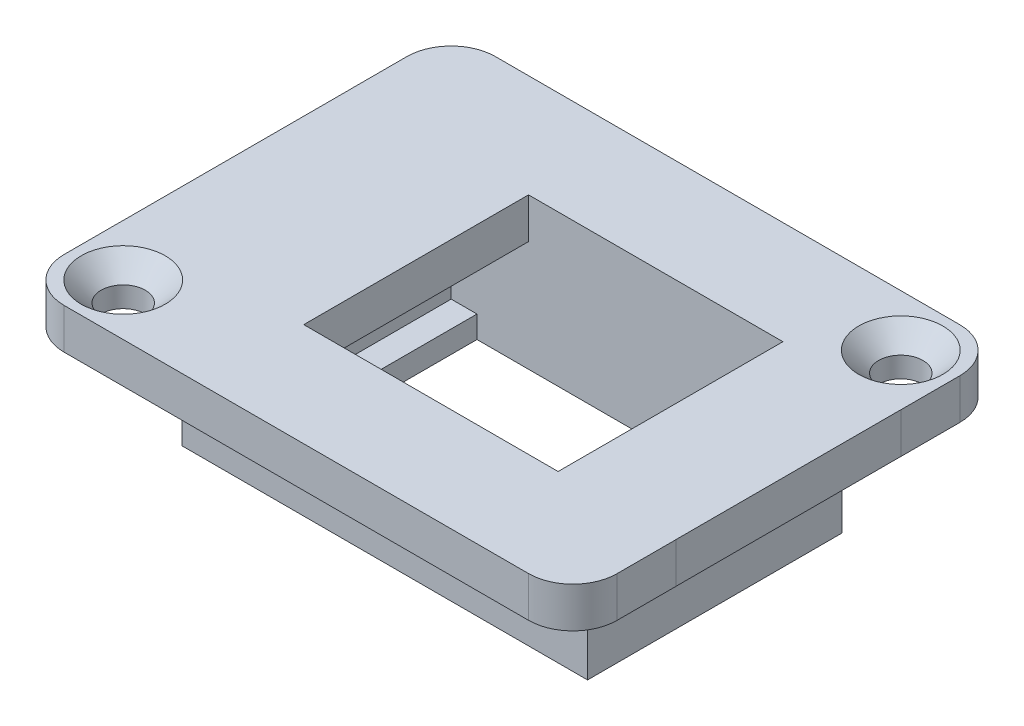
ISO-10303-21;
HEADER;
FILE_DESCRIPTION(('STEP AP214'),'2;1');
FILE_NAME('part.step','',(''),(''),'','','');
FILE_SCHEMA(('AUTOMOTIVE_DESIGN { 1 0 10303 214 1 1 1 1 }'));
ENDSEC;
DATA;
#1=APPLICATION_CONTEXT('core data for automotive mechanical design processes');
#2=APPLICATION_PROTOCOL_DEFINITION('international standard','automotive_design',2000,#1);
#3=PRODUCT_CONTEXT('',#1,'mechanical');
#4=PRODUCT('Part','Part','',(#3));
#5=PRODUCT_RELATED_PRODUCT_CATEGORY('part','',(#4));
#6=PRODUCT_DEFINITION_FORMATION('','',#4);
#7=PRODUCT_DEFINITION_CONTEXT('part definition',#1,'design');
#8=PRODUCT_DEFINITION('design','',#6,#7);
#9=PRODUCT_DEFINITION_SHAPE('','',#8);
#10=(LENGTH_UNIT() NAMED_UNIT(*) SI_UNIT(.MILLI.,.METRE.));
#11=(NAMED_UNIT(*) PLANE_ANGLE_UNIT() SI_UNIT($,.RADIAN.));
#12=(NAMED_UNIT(*) SI_UNIT($,.STERADIAN.) SOLID_ANGLE_UNIT());
#13=UNCERTAINTY_MEASURE_WITH_UNIT(LENGTH_MEASURE(1.E-05),#10,'distance_accuracy_value','');
#14=(GEOMETRIC_REPRESENTATION_CONTEXT(3) GLOBAL_UNCERTAINTY_ASSIGNED_CONTEXT((#13)) GLOBAL_UNIT_ASSIGNED_CONTEXT((#10,
#11,#12)) REPRESENTATION_CONTEXT('',''));
#15=CARTESIAN_POINT('',(0.,0.,0.));
#16=DIRECTION('',(0.,0.,1.));
#17=DIRECTION('',(1.,0.,0.));
#18=AXIS2_PLACEMENT_3D('',#15,#16,#17);
#19=CARTESIAN_POINT('',(10.753383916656,-1.9966045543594,15.25));
#20=DIRECTION('',(0.,1.,0.));
#21=DIRECTION('',(0.,0.,1.));
#22=AXIS2_PLACEMENT_3D('',#19,#20,#21);
#23=PLANE('',#22);
#24=DIRECTION('',(0.,0.,-1.));
#25=VECTOR('',#24,1.);
#26=CARTESIAN_POINT('',(-11.7499999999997,-1.99660455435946,15.25));
#27=LINE('',#26,#25);
#28=CARTESIAN_POINT('',(-11.7499999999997,-1.9966045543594,15.25));
#29=VERTEX_POINT('',#28);
#30=CARTESIAN_POINT('',(-11.7499999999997,-1.9966045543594,0.));
#31=VERTEX_POINT('',#30);
#32=EDGE_CURVE('E366',#29,#31,#27,.T.);
#33=ORIENTED_EDGE('',*,*,#32,.T.);
#34=DIRECTION('',(1.,0.,0.));
#35=VECTOR('',#34,1.);
#36=CARTESIAN_POINT('',(-13.7500000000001,-1.9966045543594,0.));
#37=LINE('',#36,#35);
#38=CARTESIAN_POINT('',(-6.50338391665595,-1.9966045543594,0.));
#39=VERTEX_POINT('',#38);
#40=EDGE_CURVE('E285',#31,#39,#37,.T.);
#41=ORIENTED_EDGE('',*,*,#40,.T.);
#42=DIRECTION('',(0.,0.,-1.));
#43=VECTOR('',#42,1.);
#44=CARTESIAN_POINT('',(-6.50338391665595,-1.9966045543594,15.25));
#45=LINE('',#44,#43);
#46=CARTESIAN_POINT('',(-6.50338391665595,-1.9966045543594,15.25));
#47=VERTEX_POINT('',#46);
#48=EDGE_CURVE('E364',#47,#39,#45,.T.);
#49=ORIENTED_EDGE('',*,*,#48,.F.);
#50=DIRECTION('',(1.,0.,0.));
#51=VECTOR('',#50,1.);
#52=CARTESIAN_POINT('',(-13.7500000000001,-1.9966045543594,15.25));
#53=LINE('',#52,#51);
#54=EDGE_CURVE('E278',#29,#47,#53,.T.);
#55=ORIENTED_EDGE('',*,*,#54,.F.);
#56=EDGE_LOOP('',(#33,#41,#49,#55));
#57=FACE_BOUND('',#56,.T.);
#58=ADVANCED_FACE('F37',(#57),#23,.F.);
#59=CARTESIAN_POINT('',(-15.2500000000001,-1.9966045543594,18.75));
#60=DIRECTION('',(0.,-1.,0.));
#61=DIRECTION('',(0.,0.,-1.));
#62=AXIS2_PLACEMENT_3D('',#59,#60,#61);
#63=CIRCLE('',#62,1.5);
#64=CARTESIAN_POINT('',(-15.2500000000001,-1.9966045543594,17.25));
#65=VERTEX_POINT('',#64);
#66=EDGE_CURVE('E299',#65,#65,#63,.T.);
#67=ORIENTED_EDGE('',*,*,#66,.F.);
#68=EDGE_LOOP('',(#67));
#69=FACE_BOUND('',#68,.T.);
#70=CARTESIAN_POINT('',(15.25,-1.9966045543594,-3.5));
#71=DIRECTION('',(0.,-1.,0.));
#72=DIRECTION('',(0.,0.,-1.));
#73=AXIS2_PLACEMENT_3D('',#70,#71,#72);
#74=CIRCLE('',#73,1.5);
#75=CARTESIAN_POINT('',(15.25,-1.9966045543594,-5.));
#76=VERTEX_POINT('',#75);
#77=EDGE_CURVE('E303',#76,#76,#74,.T.);
#78=ORIENTED_EDGE('',*,*,#77,.F.);
#79=EDGE_LOOP('',(#78));
#80=FACE_BOUND('',#79,.T.);
#81=DIRECTION('',(0.,0.,-1.));
#82=VECTOR('',#81,1.);
#83=CARTESIAN_POINT('',(18.753383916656,-1.9966045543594,22.25));
#84=LINE('',#83,#82);
#85=CARTESIAN_POINT('',(18.753383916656,-1.9966045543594,19.25));
#86=VERTEX_POINT('',#85);
#87=CARTESIAN_POINT('',(18.753383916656,-1.9966045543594,15.25));
#88=VERTEX_POINT('',#87);
#89=EDGE_CURVE('E406',#86,#88,#84,.T.);
#90=ORIENTED_EDGE('',*,*,#89,.F.);
#91=CARTESIAN_POINT('',(15.753383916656,-1.9966045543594,19.25));
#92=DIRECTION('',(0.,1.,0.));
#93=DIRECTION('',(0.,0.,1.));
#94=AXIS2_PLACEMENT_3D('',#91,#92,#93);
#95=CIRCLE('',#94,3.);
#96=CARTESIAN_POINT('',(15.753383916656,-1.9966045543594,22.25));
#97=VERTEX_POINT('',#96);
#98=EDGE_CURVE('E487',#86,#97,#95,.F.);
#99=ORIENTED_EDGE('',*,*,#98,.T.);
#100=DIRECTION('',(1.,0.,0.));
#101=VECTOR('',#100,1.);
#102=CARTESIAN_POINT('',(18.753383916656,-1.9966045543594,22.25));
#103=LINE('',#102,#101);
#104=CARTESIAN_POINT('',(-15.7533839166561,-1.9966045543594,22.25));
#105=VERTEX_POINT('',#104);
#106=EDGE_CURVE('E387',#105,#97,#103,.T.);
#107=ORIENTED_EDGE('',*,*,#106,.F.);
#108=CARTESIAN_POINT('',(-15.7533839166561,-1.9966045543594,19.25));
#109=DIRECTION('',(0.,1.,0.));
#110=DIRECTION('',(0.,0.,1.));
#111=AXIS2_PLACEMENT_3D('',#108,#109,#110);
#112=CIRCLE('',#111,3.);
#113=CARTESIAN_POINT('',(-18.7533839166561,-1.9966045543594,19.25));
#114=VERTEX_POINT('',#113);
#115=EDGE_CURVE('E485',#105,#114,#112,.F.);
#116=ORIENTED_EDGE('',*,*,#115,.T.);
#117=DIRECTION('',(0.,0.,-1.));
#118=VECTOR('',#117,1.);
#119=CARTESIAN_POINT('',(-18.7533839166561,-1.9966045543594,22.25));
#120=LINE('',#119,#118);
#121=CARTESIAN_POINT('',(-18.7533839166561,-1.9966045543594,15.25));
#122=VERTEX_POINT('',#121);
#123=EDGE_CURVE('E408',#114,#122,#120,.T.);
#124=ORIENTED_EDGE('',*,*,#123,.T.);
#125=DIRECTION('',(1.,0.,0.));
#126=VECTOR('',#125,1.);
#127=CARTESIAN_POINT('',(18.753383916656,-1.9966045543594,15.25));
#128=LINE('',#127,#126);
#129=CARTESIAN_POINT('',(-18.7500000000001,-1.9966045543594,15.25));
#130=VERTEX_POINT('',#129);
#131=EDGE_CURVE('E400',#122,#130,#128,.T.);
#132=ORIENTED_EDGE('',*,*,#131,.T.);
#133=DIRECTION('',(0.,0.,-1.));
#134=VECTOR('',#133,1.);
#135=CARTESIAN_POINT('',(-18.7500000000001,-1.9966045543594,15.25));
#136=LINE('',#135,#134);
#137=CARTESIAN_POINT('',(-18.7500000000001,-1.9966045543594,0.));
#138=VERTEX_POINT('',#137);
#139=EDGE_CURVE('E377',#130,#138,#136,.T.);
#140=ORIENTED_EDGE('',*,*,#139,.T.);
#141=DIRECTION('',(-1.,0.,0.));
#142=VECTOR('',#141,1.);
#143=CARTESIAN_POINT('',(-18.7533839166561,-1.9966045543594,0.));
#144=LINE('',#143,#142);
#145=CARTESIAN_POINT('',(-18.7533839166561,-1.9966045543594,0.));
#146=VERTEX_POINT('',#145);
#147=EDGE_CURVE('E321',#138,#146,#144,.T.);
#148=ORIENTED_EDGE('',*,*,#147,.T.);
#149=DIRECTION('',(0.,0.,1.));
#150=VECTOR('',#149,1.);
#151=CARTESIAN_POINT('',(-18.7533839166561,-1.9966045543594,-7.));
#152=LINE('',#151,#150);
#153=CARTESIAN_POINT('',(-18.7533839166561,-1.9966045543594,-4.));
#154=VERTEX_POINT('',#153);
#155=EDGE_CURVE('E328',#154,#146,#152,.T.);
#156=ORIENTED_EDGE('',*,*,#155,.F.);
#157=CARTESIAN_POINT('',(-15.7533839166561,-1.9966045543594,-4.));
#158=DIRECTION('',(0.,1.,0.));
#159=DIRECTION('',(0.,0.,1.));
#160=AXIS2_PLACEMENT_3D('',#157,#158,#159);
#161=CIRCLE('',#160,3.);
#162=CARTESIAN_POINT('',(-15.7533839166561,-1.9966045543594,-7.));
#163=VERTEX_POINT('',#162);
#164=EDGE_CURVE('E483',#154,#163,#161,.F.);
#165=ORIENTED_EDGE('',*,*,#164,.T.);
#166=DIRECTION('',(-1.,0.,0.));
#167=VECTOR('',#166,1.);
#168=CARTESIAN_POINT('',(-18.7533839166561,-1.9966045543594,-7.));
#169=LINE('',#168,#167);
#170=CARTESIAN_POINT('',(15.7533839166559,-1.9966045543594,-7.));
#171=VERTEX_POINT('',#170);
#172=EDGE_CURVE('E309',#171,#163,#169,.T.);
#173=ORIENTED_EDGE('',*,*,#172,.F.);
#174=CARTESIAN_POINT('',(15.753383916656,-1.9966045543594,-4.));
#175=DIRECTION('',(0.,1.,0.));
#176=DIRECTION('',(0.,0.,1.));
#177=AXIS2_PLACEMENT_3D('',#174,#175,#176);
#178=CIRCLE('',#177,3.);
#179=CARTESIAN_POINT('',(18.753383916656,-1.9966045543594,-4.));
#180=VERTEX_POINT('',#179);
#181=EDGE_CURVE('E481',#171,#180,#178,.F.);
#182=ORIENTED_EDGE('',*,*,#181,.T.);
#183=DIRECTION('',(0.,0.,1.));
#184=VECTOR('',#183,1.);
#185=CARTESIAN_POINT('',(18.753383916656,-1.9966045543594,-7.));
#186=LINE('',#185,#184);
#187=CARTESIAN_POINT('',(18.753383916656,-1.9966045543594,0.));
#188=VERTEX_POINT('',#187);
#189=EDGE_CURVE('E330',#180,#188,#186,.T.);
#190=ORIENTED_EDGE('',*,*,#189,.T.);
#191=CARTESIAN_POINT('',(18.75,-1.9966045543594,0.));
#192=VERTEX_POINT('',#191);
#193=EDGE_CURVE('E322',#188,#192,#144,.T.);
#194=ORIENTED_EDGE('',*,*,#193,.T.);
#195=DIRECTION('',(0.,0.,-1.));
#196=VECTOR('',#195,1.);
#197=CARTESIAN_POINT('',(18.75,-1.9966045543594,15.25));
#198=LINE('',#197,#196);
#199=CARTESIAN_POINT('',(18.75,-1.9966045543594,15.25));
#200=VERTEX_POINT('',#199);
#201=EDGE_CURVE('E454',#200,#192,#198,.T.);
#202=ORIENTED_EDGE('',*,*,#201,.F.);
#203=EDGE_CURVE('E399',#200,#88,#128,.T.);
#204=ORIENTED_EDGE('',*,*,#203,.T.);
#205=EDGE_LOOP('',(#90,#99,#107,#116,#124,#132,#140,#148,#156,#165,#173,#182,#190,#194,#202,#204));
#206=FACE_BOUND('',#205,.T.);
#207=DIRECTION('',(1.,0.,0.));
#208=VECTOR('',#207,1.);
#209=CARTESIAN_POINT('',(-13.7500000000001,-1.9966045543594,-1.));
#210=LINE('',#209,#208);
#211=CARTESIAN_POINT('',(-13.7500000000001,-1.9966045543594,-0.999999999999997));
#212=VERTEX_POINT('',#211);
#213=CARTESIAN_POINT('',(13.75,-1.9966045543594,-1.));
#214=VERTEX_POINT('',#213);
#215=EDGE_CURVE('E269',#212,#214,#210,.T.);
#216=ORIENTED_EDGE('',*,*,#215,.F.);
#217=DIRECTION('',(0.,0.,-1.));
#218=VECTOR('',#217,1.);
#219=CARTESIAN_POINT('',(-13.7500000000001,-1.9966045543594,15.25));
#220=LINE('',#219,#218);
#221=CARTESIAN_POINT('',(-13.7500000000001,-1.9966045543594,16.25));
#222=VERTEX_POINT('',#221);
#223=EDGE_CURVE('E54',#222,#212,#220,.T.);
#224=ORIENTED_EDGE('',*,*,#223,.F.);
#225=DIRECTION('',(1.,0.,0.));
#226=VECTOR('',#225,1.);
#227=CARTESIAN_POINT('',(-13.7500000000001,-1.9966045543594,16.25));
#228=LINE('',#227,#226);
#229=CARTESIAN_POINT('',(13.75,-1.9966045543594,16.25));
#230=VERTEX_POINT('',#229);
#231=EDGE_CURVE('E282',#222,#230,#228,.T.);
#232=ORIENTED_EDGE('',*,*,#231,.T.);
#233=DIRECTION('',(0.,0.,-1.));
#234=VECTOR('',#233,1.);
#235=CARTESIAN_POINT('',(13.75,-1.9966045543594,15.25));
#236=LINE('',#235,#234);
#237=EDGE_CURVE('E61',#230,#214,#236,.T.);
#238=ORIENTED_EDGE('',*,*,#237,.T.);
#239=EDGE_LOOP('',(#216,#224,#232,#238));
#240=FACE_BOUND('',#239,.T.);
#241=ADVANCED_FACE('F522',(#69,#80,#206,#240),#23,.F.);
#242=DIRECTION('',(0.,0.,-1.));
#243=VECTOR('',#242,1.);
#244=CARTESIAN_POINT('',(10.753383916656,-1.9966045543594,15.25));
#245=LINE('',#244,#243);
#246=CARTESIAN_POINT('',(10.753383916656,-1.9966045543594,15.25));
#247=VERTEX_POINT('',#246);
#248=CARTESIAN_POINT('',(10.753383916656,-1.9966045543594,0.));
#249=VERTEX_POINT('',#248);
#250=EDGE_CURVE('E445',#247,#249,#245,.T.);
#251=ORIENTED_EDGE('',*,*,#250,.T.);
#252=CARTESIAN_POINT('',(11.75,-1.9966045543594,0.));
#253=VERTEX_POINT('',#252);
#254=EDGE_CURVE('E273',#249,#253,#37,.T.);
#255=ORIENTED_EDGE('',*,*,#254,.T.);
#256=DIRECTION('',(0.,0.,-1.));
#257=VECTOR('',#256,1.);
#258=CARTESIAN_POINT('',(11.75,-1.9966045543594,15.25));
#259=LINE('',#258,#257);
#260=CARTESIAN_POINT('',(11.75,-1.9966045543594,15.25));
#261=VERTEX_POINT('',#260);
#262=EDGE_CURVE('E442',#261,#253,#259,.T.);
#263=ORIENTED_EDGE('',*,*,#262,.F.);
#264=EDGE_CURVE('E284',#247,#261,#53,.T.);
#265=ORIENTED_EDGE('',*,*,#264,.F.);
#266=EDGE_LOOP('',(#251,#255,#263,#265));
#267=FACE_BOUND('',#266,.T.);
#268=ADVANCED_FACE('F525',(#267),#23,.F.);
#269=CARTESIAN_POINT('',(0.,0.,15.25));
#270=DIRECTION('',(0.,0.,-1.));
#271=DIRECTION('',(-1.,0.,0.));
#272=AXIS2_PLACEMENT_3D('',#269,#270,#271);
#273=PLANE('',#272);
#274=DIRECTION('',(-1.,0.,0.));
#275=VECTOR('',#274,1.);
#276=CARTESIAN_POINT('',(-18.7533839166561,0.750000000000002,15.25));
#277=LINE('',#276,#275);
#278=CARTESIAN_POINT('',(-18.7500000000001,0.75,15.25));
#279=VERTEX_POINT('',#278);
#280=CARTESIAN_POINT('',(-18.7533839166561,0.750000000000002,15.25));
#281=VERTEX_POINT('',#280);
#282=EDGE_CURVE('E383',#279,#281,#277,.T.);
#283=ORIENTED_EDGE('',*,*,#282,.F.);
#284=DIRECTION('',(0.,-1.,0.));
#285=VECTOR('',#284,1.);
#286=CARTESIAN_POINT('',(-18.7500000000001,0.75,15.25));
#287=LINE('',#286,#285);
#288=EDGE_CURVE('E335',#279,#130,#287,.T.);
#289=ORIENTED_EDGE('',*,*,#288,.T.);
#290=ORIENTED_EDGE('',*,*,#131,.F.);
#291=DIRECTION('',(0.,-1.,0.));
#292=VECTOR('',#291,1.);
#293=CARTESIAN_POINT('',(-18.7533839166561,-1.9966045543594,15.25));
#294=LINE('',#293,#292);
#295=EDGE_CURVE('E395',#281,#122,#294,.T.);
#296=ORIENTED_EDGE('',*,*,#295,.F.);
#297=EDGE_LOOP('',(#283,#289,#290,#296));
#298=FACE_BOUND('',#297,.T.);
#299=ADVANCED_FACE('F533',(#298),#273,.T.);
#300=DIRECTION('',(0.,-1.,0.));
#301=VECTOR('',#300,1.);
#302=CARTESIAN_POINT('',(10.753383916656,0.75,15.25));
#303=LINE('',#302,#301);
#304=CARTESIAN_POINT('',(10.753383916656,0.75,15.25));
#305=VERTEX_POINT('',#304);
#306=EDGE_CURVE('E423',#305,#247,#303,.T.);
#307=ORIENTED_EDGE('',*,*,#306,.T.);
#308=ORIENTED_EDGE('',*,*,#264,.T.);
#309=DIRECTION('',(0.,-1.,0.));
#310=VECTOR('',#309,1.);
#311=CARTESIAN_POINT('',(11.75,-8.,15.25));
#312=LINE('',#311,#310);
#313=CARTESIAN_POINT('',(11.75,-8.,15.25));
#314=VERTEX_POINT('',#313);
#315=EDGE_CURVE('E426',#261,#314,#312,.T.);
#316=ORIENTED_EDGE('',*,*,#315,.T.);
#317=DIRECTION('',(-1.,0.,0.));
#318=VECTOR('',#317,1.);
#319=CARTESIAN_POINT('',(10.25,-8.,15.25));
#320=LINE('',#319,#318);
#321=CARTESIAN_POINT('',(10.25,-8.,15.25));
#322=VERTEX_POINT('',#321);
#323=EDGE_CURVE('E413',#314,#322,#320,.T.);
#324=ORIENTED_EDGE('',*,*,#323,.T.);
#325=DIRECTION('',(0.,-1.,0.));
#326=VECTOR('',#325,1.);
#327=CARTESIAN_POINT('',(10.25,-8.,15.25));
#328=LINE('',#327,#326);
#329=CARTESIAN_POINT('',(10.25,-9.5,15.25));
#330=VERTEX_POINT('',#329);
#331=EDGE_CURVE('E416',#322,#330,#328,.T.);
#332=ORIENTED_EDGE('',*,*,#331,.T.);
#333=DIRECTION('',(1.,0.,0.));
#334=VECTOR('',#333,1.);
#335=CARTESIAN_POINT('',(-13.7500000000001,-9.50000000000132,15.25));
#336=LINE('',#335,#334);
#337=CARTESIAN_POINT('',(-10.0000000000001,-9.50000000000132,15.25));
#338=VERTEX_POINT('',#337);
#339=EDGE_CURVE('E277',#338,#330,#336,.T.);
#340=ORIENTED_EDGE('',*,*,#339,.F.);
#341=DIRECTION('',(0.,1.,0.));
#342=VECTOR('',#341,1.);
#343=CARTESIAN_POINT('',(-10.0000000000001,-9.50000000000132,15.25));
#344=LINE('',#343,#342);
#345=CARTESIAN_POINT('',(-10.0000000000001,-8.00000000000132,15.25));
#346=VERTEX_POINT('',#345);
#347=EDGE_CURVE('E338',#338,#346,#344,.T.);
#348=ORIENTED_EDGE('',*,*,#347,.T.);
#349=DIRECTION('',(-1.,0.,0.));
#350=VECTOR('',#349,1.);
#351=CARTESIAN_POINT('',(-11.7499999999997,-8.00000000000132,15.25));
#352=LINE('',#351,#350);
#353=CARTESIAN_POINT('',(-11.7499999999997,-8.00000000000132,15.25));
#354=VERTEX_POINT('',#353);
#355=EDGE_CURVE('E342',#346,#354,#352,.T.);
#356=ORIENTED_EDGE('',*,*,#355,.T.);
#357=DIRECTION('',(0.,1.,0.));
#358=VECTOR('',#357,1.);
#359=CARTESIAN_POINT('',(-11.7499999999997,-8.00000000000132,15.25));
#360=LINE('',#359,#358);
#361=EDGE_CURVE('E345',#354,#29,#360,.T.);
#362=ORIENTED_EDGE('',*,*,#361,.T.);
#363=ORIENTED_EDGE('',*,*,#54,.T.);
#364=DIRECTION('',(0.,1.,0.));
#365=VECTOR('',#364,1.);
#366=CARTESIAN_POINT('',(-6.50338391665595,0.75,15.25));
#367=LINE('',#366,#365);
#368=CARTESIAN_POINT('',(-6.50338391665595,0.750000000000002,15.25));
#369=VERTEX_POINT('',#368);
#370=EDGE_CURVE('E348',#47,#369,#367,.T.);
#371=ORIENTED_EDGE('',*,*,#370,.T.);
#372=EDGE_CURVE('E396',#305,#369,#277,.T.);
#373=ORIENTED_EDGE('',*,*,#372,.F.);
#374=EDGE_LOOP('',(#307,#308,#316,#324,#332,#340,#348,#356,#362,#363,#371,#373));
#375=FACE_BOUND('',#374,.T.);
#376=ADVANCED_FACE('F538',(#375),#273,.T.);
#377=CARTESIAN_POINT('',(10.25,-8.,15.25));
#378=DIRECTION('',(0.,-1.,0.));
#379=DIRECTION('',(1.,0.,0.));
#380=AXIS2_PLACEMENT_3D('',#377,#378,#379);
#381=PLANE('',#380);
#382=DIRECTION('',(-1.,0.,0.));
#383=VECTOR('',#382,1.);
#384=CARTESIAN_POINT('',(10.25,-8.,0.));
#385=LINE('',#384,#383);
#386=CARTESIAN_POINT('',(11.75,-8.,0.));
#387=VERTEX_POINT('',#386);
#388=CARTESIAN_POINT('',(10.25,-8.,0.));
#389=VERTEX_POINT('',#388);
#390=EDGE_CURVE('E412',#387,#389,#385,.T.);
#391=ORIENTED_EDGE('',*,*,#390,.T.);
#392=DIRECTION('',(0.,0.,-1.));
#393=VECTOR('',#392,1.);
#394=CARTESIAN_POINT('',(10.25,-8.,15.25));
#395=LINE('',#394,#393);
#396=EDGE_CURVE('E463',#322,#389,#395,.T.);
#397=ORIENTED_EDGE('',*,*,#396,.F.);
#398=ORIENTED_EDGE('',*,*,#323,.F.);
#399=DIRECTION('',(0.,0.,-1.));
#400=VECTOR('',#399,1.);
#401=CARTESIAN_POINT('',(11.75,-8.,15.25));
#402=LINE('',#401,#400);
#403=EDGE_CURVE('E429',#314,#387,#402,.T.);
#404=ORIENTED_EDGE('',*,*,#403,.T.);
#405=EDGE_LOOP('',(#391,#397,#398,#404));
#406=FACE_BOUND('',#405,.T.);
#407=ADVANCED_FACE('F573',(#406),#381,.F.);
#408=CARTESIAN_POINT('',(10.25,-8.,15.25));
#409=DIRECTION('',(1.,0.,0.));
#410=DIRECTION('',(0.,0.,-1.));
#411=AXIS2_PLACEMENT_3D('',#408,#409,#410);
#412=PLANE('',#411);
#413=DIRECTION('',(0.,-1.,0.));
#414=VECTOR('',#413,1.);
#415=CARTESIAN_POINT('',(10.25,-8.,0.));
#416=LINE('',#415,#414);
#417=CARTESIAN_POINT('',(10.25,-9.5,0.));
#418=VERTEX_POINT('',#417);
#419=EDGE_CURVE('E432',#389,#418,#416,.T.);
#420=ORIENTED_EDGE('',*,*,#419,.T.);
#421=DIRECTION('',(0.,0.,-1.));
#422=VECTOR('',#421,1.);
#423=CARTESIAN_POINT('',(10.25,-9.5,15.25));
#424=LINE('',#423,#422);
#425=EDGE_CURVE('E460',#330,#418,#424,.T.);
#426=ORIENTED_EDGE('',*,*,#425,.F.);
#427=ORIENTED_EDGE('',*,*,#331,.F.);
#428=ORIENTED_EDGE('',*,*,#396,.T.);
#429=EDGE_LOOP('',(#420,#426,#427,#428));
#430=FACE_BOUND('',#429,.T.);
#431=ADVANCED_FACE('F566',(#430),#412,.F.);
#432=CARTESIAN_POINT('',(10.25,-9.5,15.25));
#433=DIRECTION('',(0.,1.,0.));
#434=DIRECTION('',(0.,0.,1.));
#435=AXIS2_PLACEMENT_3D('',#432,#433,#434);
#436=PLANE('',#435);
#437=DIRECTION('',(1.,0.,0.));
#438=VECTOR('',#437,1.);
#439=CARTESIAN_POINT('',(-13.7500000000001,-9.50000000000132,0.));
#440=LINE('',#439,#438);
#441=CARTESIAN_POINT('',(-10.0000000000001,-9.50000000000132,0.));
#442=VERTEX_POINT('',#441);
#443=EDGE_CURVE('E266',#442,#418,#440,.T.);
#444=ORIENTED_EDGE('',*,*,#443,.F.);
#445=DIRECTION('',(0.,0.,-1.));
#446=VECTOR('',#445,1.);
#447=CARTESIAN_POINT('',(-10.0000000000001,-9.50000000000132,15.25));
#448=LINE('',#447,#446);
#449=EDGE_CURVE('E256',#338,#442,#448,.T.);
#450=ORIENTED_EDGE('',*,*,#449,.F.);
#451=ORIENTED_EDGE('',*,*,#339,.T.);
#452=ORIENTED_EDGE('',*,*,#425,.T.);
#453=EDGE_LOOP('',(#444,#450,#451,#452));
#454=FACE_BOUND('',#453,.T.);
#455=DIRECTION('',(0.,0.,-1.));
#456=VECTOR('',#455,1.);
#457=CARTESIAN_POINT('',(-13.7500000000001,-9.50000000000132,15.25));
#458=LINE('',#457,#456);
#459=CARTESIAN_POINT('',(-13.7500000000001,-9.50000000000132,16.25));
#460=VERTEX_POINT('',#459);
#461=CARTESIAN_POINT('',(-13.7500000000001,-9.50000000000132,-1.));
#462=VERTEX_POINT('',#461);
#463=EDGE_CURVE('E248',#460,#462,#458,.T.);
#464=ORIENTED_EDGE('',*,*,#463,.T.);
#465=DIRECTION('',(1.,0.,0.));
#466=VECTOR('',#465,1.);
#467=CARTESIAN_POINT('',(-13.7500000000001,-9.50000000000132,-1.));
#468=LINE('',#467,#466);
#469=CARTESIAN_POINT('',(13.75,-9.50000000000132,-1.));
#470=VERTEX_POINT('',#469);
#471=EDGE_CURVE('E251',#462,#470,#468,.T.);
#472=ORIENTED_EDGE('',*,*,#471,.T.);
#473=DIRECTION('',(0.,0.,-1.));
#474=VECTOR('',#473,1.);
#475=CARTESIAN_POINT('',(13.75,-9.5,15.25));
#476=LINE('',#475,#474);
#477=CARTESIAN_POINT('',(13.75,-9.50000000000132,16.25));
#478=VERTEX_POINT('',#477);
#479=EDGE_CURVE('E458',#478,#470,#476,.T.);
#480=ORIENTED_EDGE('',*,*,#479,.F.);
#481=DIRECTION('',(1.,0.,0.));
#482=VECTOR('',#481,1.);
#483=CARTESIAN_POINT('',(-13.7500000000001,-9.50000000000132,16.25));
#484=LINE('',#483,#482);
#485=EDGE_CURVE('E254',#460,#478,#484,.T.);
#486=ORIENTED_EDGE('',*,*,#485,.F.);
#487=EDGE_LOOP('',(#464,#472,#480,#486));
#488=FACE_BOUND('',#487,.T.);
#489=ADVANCED_FACE('F249',(#454,#488),#436,.F.);
#490=CARTESIAN_POINT('',(13.75,-1.9966045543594,15.25));
#491=DIRECTION('',(-1.,0.,0.));
#492=DIRECTION('',(0.,0.,1.));
#493=AXIS2_PLACEMENT_3D('',#490,#491,#492);
#494=PLANE('',#493);
#495=ORIENTED_EDGE('',*,*,#479,.T.);
#496=DIRECTION('',(0.,1.,0.));
#497=VECTOR('',#496,1.);
#498=CARTESIAN_POINT('',(13.75,-9.50000000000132,-1.));
#499=LINE('',#498,#497);
#500=EDGE_CURVE('E263',#470,#214,#499,.T.);
#501=ORIENTED_EDGE('',*,*,#500,.T.);
#502=ORIENTED_EDGE('',*,*,#237,.F.);
#503=DIRECTION('',(0.,1.,0.));
#504=VECTOR('',#503,1.);
#505=CARTESIAN_POINT('',(13.75,-9.50000000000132,16.25));
#506=LINE('',#505,#504);
#507=EDGE_CURVE('E288',#478,#230,#506,.T.);
#508=ORIENTED_EDGE('',*,*,#507,.F.);
#509=EDGE_LOOP('',(#495,#501,#502,#508));
#510=FACE_BOUND('',#509,.T.);
#511=ADVANCED_FACE('F555',(#510),#494,.F.);
#512=CARTESIAN_POINT('',(18.75,0.75,15.25));
#513=DIRECTION('',(-1.,0.,0.));
#514=DIRECTION('',(0.,0.,1.));
#515=AXIS2_PLACEMENT_3D('',#512,#513,#514);
#516=PLANE('',#515);
#517=DIRECTION('',(0.,1.,0.));
#518=VECTOR('',#517,1.);
#519=CARTESIAN_POINT('',(18.75,0.75,0.));
#520=LINE('',#519,#518);
#521=CARTESIAN_POINT('',(18.75,0.75,0.));
#522=VERTEX_POINT('',#521);
#523=EDGE_CURVE('E434',#192,#522,#520,.T.);
#524=ORIENTED_EDGE('',*,*,#523,.T.);
#525=DIRECTION('',(0.,0.,-1.));
#526=VECTOR('',#525,1.);
#527=CARTESIAN_POINT('',(18.75,0.75,15.25));
#528=LINE('',#527,#526);
#529=CARTESIAN_POINT('',(18.75,0.75,15.25));
#530=VERTEX_POINT('',#529);
#531=EDGE_CURVE('E451',#530,#522,#528,.T.);
#532=ORIENTED_EDGE('',*,*,#531,.F.);
#533=DIRECTION('',(0.,1.,0.));
#534=VECTOR('',#533,1.);
#535=CARTESIAN_POINT('',(18.75,0.75,15.25));
#536=LINE('',#535,#534);
#537=EDGE_CURVE('E420',#200,#530,#536,.T.);
#538=ORIENTED_EDGE('',*,*,#537,.F.);
#539=ORIENTED_EDGE('',*,*,#201,.T.);
#540=EDGE_LOOP('',(#524,#532,#538,#539));
#541=FACE_BOUND('',#540,.T.);
#542=ADVANCED_FACE('F557',(#541),#516,.F.);
#543=CARTESIAN_POINT('',(10.753383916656,0.75,15.25));
#544=DIRECTION('',(0.,-1.,0.));
#545=DIRECTION('',(0.,0.,-1.));
#546=AXIS2_PLACEMENT_3D('',#543,#544,#545);
#547=PLANE('',#546);
#548=CARTESIAN_POINT('',(-15.2500000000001,0.75,18.75));
#549=DIRECTION('',(0.,1.,0.));
#550=DIRECTION('',(0.,0.,1.));
#551=AXIS2_PLACEMENT_3D('',#548,#549,#550);
#552=CIRCLE('',#551,2.85);
#553=CARTESIAN_POINT('',(-15.2500000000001,0.75,21.6));
#554=VERTEX_POINT('',#553);
#555=EDGE_CURVE('E293',#554,#554,#552,.T.);
#556=ORIENTED_EDGE('',*,*,#555,.F.);
#557=EDGE_LOOP('',(#556));
#558=FACE_BOUND('',#557,.T.);
#559=CARTESIAN_POINT('',(15.25,0.75,-3.5));
#560=DIRECTION('',(0.,1.,0.));
#561=DIRECTION('',(0.,0.,1.));
#562=AXIS2_PLACEMENT_3D('',#559,#560,#561);
#563=CIRCLE('',#562,2.85);
#564=CARTESIAN_POINT('',(15.25,0.75,-0.649999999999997));
#565=VERTEX_POINT('',#564);
#566=EDGE_CURVE('E291',#565,#565,#563,.T.);
#567=ORIENTED_EDGE('',*,*,#566,.F.);
#568=EDGE_LOOP('',(#567));
#569=FACE_BOUND('',#568,.T.);
#570=DIRECTION('',(1.,0.,0.));
#571=VECTOR('',#570,1.);
#572=CARTESIAN_POINT('',(18.753383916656,0.75,0.));
#573=LINE('',#572,#571);
#574=CARTESIAN_POINT('',(-6.50338391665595,0.75,0.));
#575=VERTEX_POINT('',#574);
#576=CARTESIAN_POINT('',(10.753383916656,0.75,0.));
#577=VERTEX_POINT('',#576);
#578=EDGE_CURVE('E318',#575,#577,#573,.T.);
#579=ORIENTED_EDGE('',*,*,#578,.T.);
#580=DIRECTION('',(0.,0.,-1.));
#581=VECTOR('',#580,1.);
#582=CARTESIAN_POINT('',(10.753383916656,0.75,15.25));
#583=LINE('',#582,#581);
#584=EDGE_CURVE('E448',#305,#577,#583,.T.);
#585=ORIENTED_EDGE('',*,*,#584,.F.);
#586=ORIENTED_EDGE('',*,*,#372,.T.);
#587=DIRECTION('',(0.,0.,-1.));
#588=VECTOR('',#587,1.);
#589=CARTESIAN_POINT('',(-6.50338391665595,0.75,15.25));
#590=LINE('',#589,#588);
#591=EDGE_CURVE('E351',#369,#575,#590,.T.);
#592=ORIENTED_EDGE('',*,*,#591,.T.);
#593=EDGE_LOOP('',(#579,#585,#586,#592));
#594=FACE_BOUND('',#593,.T.);
#595=DIRECTION('',(-1.,0.,0.));
#596=VECTOR('',#595,1.);
#597=CARTESIAN_POINT('',(-18.7533839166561,0.750000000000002,22.25));
#598=LINE('',#597,#596);
#599=CARTESIAN_POINT('',(15.7533839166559,0.750000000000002,22.25));
#600=VERTEX_POINT('',#599);
#601=CARTESIAN_POINT('',(-15.7533839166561,0.750000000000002,22.25));
#602=VERTEX_POINT('',#601);
#603=EDGE_CURVE('E384',#600,#602,#598,.T.);
#604=ORIENTED_EDGE('',*,*,#603,.F.);
#605=CARTESIAN_POINT('',(15.753383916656,0.75,19.25));
#606=DIRECTION('',(0.,-1.,0.));
#607=DIRECTION('',(0.,0.,-1.));
#608=AXIS2_PLACEMENT_3D('',#605,#606,#607);
#609=CIRCLE('',#608,3.);
#610=CARTESIAN_POINT('',(18.753383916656,0.750000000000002,19.25));
#611=VERTEX_POINT('',#610);
#612=EDGE_CURVE('E477',#600,#611,#609,.F.);
#613=ORIENTED_EDGE('',*,*,#612,.T.);
#614=DIRECTION('',(0.,0.,-1.));
#615=VECTOR('',#614,1.);
#616=CARTESIAN_POINT('',(18.753383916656,0.750000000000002,22.25));
#617=LINE('',#616,#615);
#618=CARTESIAN_POINT('',(18.753383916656,0.750000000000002,15.25));
#619=VERTEX_POINT('',#618);
#620=EDGE_CURVE('E391',#611,#619,#617,.T.);
#621=ORIENTED_EDGE('',*,*,#620,.T.);
#622=EDGE_CURVE('E392',#619,#530,#277,.T.);
#623=ORIENTED_EDGE('',*,*,#622,.T.);
#624=ORIENTED_EDGE('',*,*,#531,.T.);
#625=CARTESIAN_POINT('',(18.753383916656,0.75,0.));
#626=VERTEX_POINT('',#625);
#627=EDGE_CURVE('E302',#522,#626,#573,.T.);
#628=ORIENTED_EDGE('',*,*,#627,.T.);
#629=DIRECTION('',(0.,0.,1.));
#630=VECTOR('',#629,1.);
#631=CARTESIAN_POINT('',(18.753383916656,0.75,-7.));
#632=LINE('',#631,#630);
#633=CARTESIAN_POINT('',(18.753383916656,0.75,-4.));
#634=VERTEX_POINT('',#633);
#635=EDGE_CURVE('E332',#634,#626,#632,.T.);
#636=ORIENTED_EDGE('',*,*,#635,.F.);
#637=CARTESIAN_POINT('',(15.753383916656,0.75,-4.));
#638=DIRECTION('',(0.,-1.,0.));
#639=DIRECTION('',(0.,0.,-1.));
#640=AXIS2_PLACEMENT_3D('',#637,#638,#639);
#641=CIRCLE('',#640,3.);
#642=CARTESIAN_POINT('',(15.753383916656,0.75,-7.));
#643=VERTEX_POINT('',#642);
#644=EDGE_CURVE('E471',#634,#643,#641,.F.);
#645=ORIENTED_EDGE('',*,*,#644,.T.);
#646=DIRECTION('',(1.,0.,0.));
#647=VECTOR('',#646,1.);
#648=CARTESIAN_POINT('',(18.753383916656,0.75,-7.));
#649=LINE('',#648,#647);
#650=CARTESIAN_POINT('',(-15.7533839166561,0.75,-7.));
#651=VERTEX_POINT('',#650);
#652=EDGE_CURVE('E306',#651,#643,#649,.T.);
#653=ORIENTED_EDGE('',*,*,#652,.F.);
#654=CARTESIAN_POINT('',(-15.7533839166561,0.75,-4.));
#655=DIRECTION('',(0.,-1.,0.));
#656=DIRECTION('',(0.,0.,-1.));
#657=AXIS2_PLACEMENT_3D('',#654,#655,#656);
#658=CIRCLE('',#657,3.);
#659=CARTESIAN_POINT('',(-18.7533839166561,0.75,-4.));
#660=VERTEX_POINT('',#659);
#661=EDGE_CURVE('E473',#651,#660,#658,.F.);
#662=ORIENTED_EDGE('',*,*,#661,.T.);
#663=DIRECTION('',(0.,0.,1.));
#664=VECTOR('',#663,1.);
#665=CARTESIAN_POINT('',(-18.7533839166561,0.75,-7.));
#666=LINE('',#665,#664);
#667=CARTESIAN_POINT('',(-18.7533839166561,0.75,0.));
#668=VERTEX_POINT('',#667);
#669=EDGE_CURVE('E313',#660,#668,#666,.T.);
#670=ORIENTED_EDGE('',*,*,#669,.T.);
#671=CARTESIAN_POINT('',(-18.7500000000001,0.75,0.));
#672=VERTEX_POINT('',#671);
#673=EDGE_CURVE('E314',#668,#672,#573,.T.);
#674=ORIENTED_EDGE('',*,*,#673,.T.);
#675=DIRECTION('',(0.,0.,-1.));
#676=VECTOR('',#675,1.);
#677=CARTESIAN_POINT('',(-18.7500000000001,0.75,15.25));
#678=LINE('',#677,#676);
#679=EDGE_CURVE('E380',#279,#672,#678,.T.);
#680=ORIENTED_EDGE('',*,*,#679,.F.);
#681=ORIENTED_EDGE('',*,*,#282,.T.);
#682=DIRECTION('',(0.,0.,-1.));
#683=VECTOR('',#682,1.);
#684=CARTESIAN_POINT('',(-18.7533839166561,0.750000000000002,22.25));
#685=LINE('',#684,#683);
#686=CARTESIAN_POINT('',(-18.7533839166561,0.750000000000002,19.25));
#687=VERTEX_POINT('',#686);
#688=EDGE_CURVE('E410',#687,#281,#685,.T.);
#689=ORIENTED_EDGE('',*,*,#688,.F.);
#690=CARTESIAN_POINT('',(-15.7533839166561,0.75,19.25));
#691=DIRECTION('',(0.,-1.,0.));
#692=DIRECTION('',(0.,0.,-1.));
#693=AXIS2_PLACEMENT_3D('',#690,#691,#692);
#694=CIRCLE('',#693,3.);
#695=EDGE_CURVE('E475',#687,#602,#694,.F.);
#696=ORIENTED_EDGE('',*,*,#695,.T.);
#697=EDGE_LOOP('',(#604,#613,#621,#623,#624,#628,#636,#645,#653,#662,#670,#674,#680,#681,#689,#696));
#698=FACE_BOUND('',#697,.T.);
#699=ADVANCED_FACE('F563',(#558,#569,#594,#698),#547,.F.);
#700=CARTESIAN_POINT('',(10.753383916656,0.75,15.25));
#701=DIRECTION('',(1.,0.,0.));
#702=DIRECTION('',(0.,0.,-1.));
#703=AXIS2_PLACEMENT_3D('',#700,#701,#702);
#704=PLANE('',#703);
#705=DIRECTION('',(0.,-1.,0.));
#706=VECTOR('',#705,1.);
#707=CARTESIAN_POINT('',(10.753383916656,0.75,0.));
#708=LINE('',#707,#706);
#709=EDGE_CURVE('E437',#577,#249,#708,.T.);
#710=ORIENTED_EDGE('',*,*,#709,.T.);
#711=ORIENTED_EDGE('',*,*,#250,.F.);
#712=ORIENTED_EDGE('',*,*,#306,.F.);
#713=ORIENTED_EDGE('',*,*,#584,.T.);
#714=EDGE_LOOP('',(#710,#711,#712,#713));
#715=FACE_BOUND('',#714,.T.);
#716=ADVANCED_FACE('F691',(#715),#704,.F.);
#717=CARTESIAN_POINT('',(11.75,-8.,15.25));
#718=DIRECTION('',(1.,0.,0.));
#719=DIRECTION('',(0.,0.,-1.));
#720=AXIS2_PLACEMENT_3D('',#717,#718,#719);
#721=PLANE('',#720);
#722=DIRECTION('',(0.,-1.,0.));
#723=VECTOR('',#722,1.);
#724=CARTESIAN_POINT('',(11.75,-8.,0.));
#725=LINE('',#724,#723);
#726=EDGE_CURVE('E417',#253,#387,#725,.T.);
#727=ORIENTED_EDGE('',*,*,#726,.T.);
#728=ORIENTED_EDGE('',*,*,#403,.F.);
#729=ORIENTED_EDGE('',*,*,#315,.F.);
#730=ORIENTED_EDGE('',*,*,#262,.T.);
#731=EDGE_LOOP('',(#727,#728,#729,#730));
#732=FACE_BOUND('',#731,.T.);
#733=ADVANCED_FACE('F689',(#732),#721,.F.);
#734=ORIENTED_EDGE('',*,*,#203,.F.);
#735=ORIENTED_EDGE('',*,*,#537,.T.);
#736=ORIENTED_EDGE('',*,*,#622,.F.);
#737=DIRECTION('',(0.,1.,0.));
#738=VECTOR('',#737,1.);
#739=CARTESIAN_POINT('',(18.753383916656,0.750000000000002,15.25));
#740=LINE('',#739,#738);
#741=EDGE_CURVE('E388',#88,#619,#740,.T.);
#742=ORIENTED_EDGE('',*,*,#741,.F.);
#743=EDGE_LOOP('',(#734,#735,#736,#742));
#744=FACE_BOUND('',#743,.T.);
#745=ADVANCED_FACE('F541',(#744),#273,.T.);
#746=CARTESIAN_POINT('',(-18.7533839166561,-1.9966045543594,22.25));
#747=DIRECTION('',(1.,0.,0.));
#748=DIRECTION('',(0.,0.,-1.));
#749=AXIS2_PLACEMENT_3D('',#746,#747,#748);
#750=PLANE('',#749);
#751=ORIENTED_EDGE('',*,*,#123,.F.);
#752=DIRECTION('',(0.,-1.,0.));
#753=VECTOR('',#752,1.);
#754=CARTESIAN_POINT('',(-18.7533839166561,-1.9966045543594,19.25));
#755=LINE('',#754,#753);
#756=EDGE_CURVE('E489',#114,#687,#755,.F.);
#757=ORIENTED_EDGE('',*,*,#756,.T.);
#758=ORIENTED_EDGE('',*,*,#688,.T.);
#759=ORIENTED_EDGE('',*,*,#295,.T.);
#760=EDGE_LOOP('',(#751,#757,#758,#759));
#761=FACE_BOUND('',#760,.T.);
#762=ADVANCED_FACE('F640',(#761),#750,.F.);
#763=CARTESIAN_POINT('',(18.753383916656,0.750000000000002,22.25));
#764=DIRECTION('',(-1.,0.,0.));
#765=DIRECTION('',(0.,0.,1.));
#766=AXIS2_PLACEMENT_3D('',#763,#764,#765);
#767=PLANE('',#766);
#768=ORIENTED_EDGE('',*,*,#620,.F.);
#769=DIRECTION('',(0.,1.,0.));
#770=VECTOR('',#769,1.);
#771=CARTESIAN_POINT('',(18.753383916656,0.750000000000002,19.25));
#772=LINE('',#771,#770);
#773=EDGE_CURVE('E479',#611,#86,#772,.F.);
#774=ORIENTED_EDGE('',*,*,#773,.T.);
#775=ORIENTED_EDGE('',*,*,#89,.T.);
#776=ORIENTED_EDGE('',*,*,#741,.T.);
#777=EDGE_LOOP('',(#768,#774,#775,#776));
#778=FACE_BOUND('',#777,.T.);
#779=ADVANCED_FACE('F627',(#778),#767,.F.);
#780=CARTESIAN_POINT('',(0.,0.,22.25));
#781=DIRECTION('',(0.,0.,-1.));
#782=DIRECTION('',(-1.,0.,0.));
#783=AXIS2_PLACEMENT_3D('',#780,#781,#782);
#784=PLANE('',#783);
#785=ORIENTED_EDGE('',*,*,#106,.T.);
#786=DIRECTION('',(0.,1.,0.));
#787=VECTOR('',#786,1.);
#788=CARTESIAN_POINT('',(15.753383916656,0.,22.25));
#789=LINE('',#788,#787);
#790=EDGE_CURVE('E468',#97,#600,#789,.T.);
#791=ORIENTED_EDGE('',*,*,#790,.T.);
#792=ORIENTED_EDGE('',*,*,#603,.T.);
#793=DIRECTION('',(0.,-1.,0.));
#794=VECTOR('',#793,1.);
#795=CARTESIAN_POINT('',(-15.7533839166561,0.,22.25));
#796=LINE('',#795,#794);
#797=EDGE_CURVE('E465',#602,#105,#796,.T.);
#798=ORIENTED_EDGE('',*,*,#797,.T.);
#799=EDGE_LOOP('',(#785,#791,#792,#798));
#800=FACE_BOUND('',#799,.T.);
#801=ADVANCED_FACE('F632',(#800),#784,.F.);
#802=CARTESIAN_POINT('',(-18.7500000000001,0.75,15.25));
#803=DIRECTION('',(1.,0.,0.));
#804=DIRECTION('',(0.,0.,-1.));
#805=AXIS2_PLACEMENT_3D('',#802,#803,#804);
#806=PLANE('',#805);
#807=DIRECTION('',(0.,-1.,0.));
#808=VECTOR('',#807,1.);
#809=CARTESIAN_POINT('',(-18.7500000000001,0.75,0.));
#810=LINE('',#809,#808);
#811=EDGE_CURVE('E334',#672,#138,#810,.T.);
#812=ORIENTED_EDGE('',*,*,#811,.T.);
#813=ORIENTED_EDGE('',*,*,#139,.F.);
#814=ORIENTED_EDGE('',*,*,#288,.F.);
#815=ORIENTED_EDGE('',*,*,#679,.T.);
#816=EDGE_LOOP('',(#812,#813,#814,#815));
#817=FACE_BOUND('',#816,.T.);
#818=ADVANCED_FACE('F646',(#817),#806,.F.);
#819=CARTESIAN_POINT('',(-13.7500000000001,-1.9966045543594,15.25));
#820=DIRECTION('',(1.,0.,0.));
#821=DIRECTION('',(0.,0.,-1.));
#822=AXIS2_PLACEMENT_3D('',#819,#820,#821);
#823=PLANE('',#822);
#824=ORIENTED_EDGE('',*,*,#223,.T.);
#825=DIRECTION('',(0.,1.,0.));
#826=VECTOR('',#825,1.);
#827=CARTESIAN_POINT('',(-13.7500000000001,-9.50000000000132,-1.));
#828=LINE('',#827,#826);
#829=EDGE_CURVE('E259',#462,#212,#828,.T.);
#830=ORIENTED_EDGE('',*,*,#829,.F.);
#831=ORIENTED_EDGE('',*,*,#463,.F.);
#832=DIRECTION('',(0.,1.,0.));
#833=VECTOR('',#832,1.);
#834=CARTESIAN_POINT('',(-13.7500000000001,-9.50000000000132,16.25));
#835=LINE('',#834,#833);
#836=EDGE_CURVE('E281',#460,#222,#835,.T.);
#837=ORIENTED_EDGE('',*,*,#836,.T.);
#838=EDGE_LOOP('',(#824,#830,#831,#837));
#839=FACE_BOUND('',#838,.T.);
#840=ADVANCED_FACE('F260',(#839),#823,.F.);
#841=CARTESIAN_POINT('',(-10.0000000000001,-9.50000000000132,15.25));
#842=DIRECTION('',(-1.,0.,0.));
#843=DIRECTION('',(0.,0.,1.));
#844=AXIS2_PLACEMENT_3D('',#841,#842,#843);
#845=PLANE('',#844);
#846=DIRECTION('',(0.,1.,0.));
#847=VECTOR('',#846,1.);
#848=CARTESIAN_POINT('',(-10.0000000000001,-9.50000000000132,0.));
#849=LINE('',#848,#847);
#850=CARTESIAN_POINT('',(-10.0000000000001,-8.00000000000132,0.));
#851=VERTEX_POINT('',#850);
#852=EDGE_CURVE('E354',#442,#851,#849,.T.);
#853=ORIENTED_EDGE('',*,*,#852,.T.);
#854=DIRECTION('',(0.,0.,-1.));
#855=VECTOR('',#854,1.);
#856=CARTESIAN_POINT('',(-10.0000000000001,-8.00000000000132,15.25));
#857=LINE('',#856,#855);
#858=EDGE_CURVE('E372',#346,#851,#857,.T.);
#859=ORIENTED_EDGE('',*,*,#858,.F.);
#860=ORIENTED_EDGE('',*,*,#347,.F.);
#861=ORIENTED_EDGE('',*,*,#449,.T.);
#862=EDGE_LOOP('',(#853,#859,#860,#861));
#863=FACE_BOUND('',#862,.T.);
#864=ADVANCED_FACE('F675',(#863),#845,.F.);
#865=CARTESIAN_POINT('',(-11.7499999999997,-8.00000000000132,15.25));
#866=DIRECTION('',(0.,-1.,0.));
#867=DIRECTION('',(0.,0.,-1.));
#868=AXIS2_PLACEMENT_3D('',#865,#866,#867);
#869=PLANE('',#868);
#870=DIRECTION('',(-1.,0.,0.));
#871=VECTOR('',#870,1.);
#872=CARTESIAN_POINT('',(-11.7499999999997,-8.00000000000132,0.));
#873=LINE('',#872,#871);
#874=CARTESIAN_POINT('',(-11.7499999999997,-8.00000000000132,0.));
#875=VERTEX_POINT('',#874);
#876=EDGE_CURVE('E356',#851,#875,#873,.T.);
#877=ORIENTED_EDGE('',*,*,#876,.T.);
#878=DIRECTION('',(0.,0.,-1.));
#879=VECTOR('',#878,1.);
#880=CARTESIAN_POINT('',(-11.7499999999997,-8.00000000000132,15.25));
#881=LINE('',#880,#879);
#882=EDGE_CURVE('E369',#354,#875,#881,.T.);
#883=ORIENTED_EDGE('',*,*,#882,.F.);
#884=ORIENTED_EDGE('',*,*,#355,.F.);
#885=ORIENTED_EDGE('',*,*,#858,.T.);
#886=EDGE_LOOP('',(#877,#883,#884,#885));
#887=FACE_BOUND('',#886,.T.);
#888=ADVANCED_FACE('F671',(#887),#869,.F.);
#889=CARTESIAN_POINT('',(-11.7499999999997,-8.00000000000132,15.25));
#890=DIRECTION('',(-1.,0.,0.));
#891=DIRECTION('',(0.,-1.,0.));
#892=AXIS2_PLACEMENT_3D('',#889,#890,#891);
#893=PLANE('',#892);
#894=DIRECTION('',(0.,1.,0.));
#895=VECTOR('',#894,1.);
#896=CARTESIAN_POINT('',(-11.7499999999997,-8.00000000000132,0.));
#897=LINE('',#896,#895);
#898=EDGE_CURVE('E358',#875,#31,#897,.T.);
#899=ORIENTED_EDGE('',*,*,#898,.T.);
#900=ORIENTED_EDGE('',*,*,#32,.F.);
#901=ORIENTED_EDGE('',*,*,#361,.F.);
#902=ORIENTED_EDGE('',*,*,#882,.T.);
#903=EDGE_LOOP('',(#899,#900,#901,#902));
#904=FACE_BOUND('',#903,.T.);
#905=ADVANCED_FACE('F667',(#904),#893,.F.);
#906=CARTESIAN_POINT('',(-6.50338391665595,0.75,15.25));
#907=DIRECTION('',(-1.,0.,0.));
#908=DIRECTION('',(0.,0.,1.));
#909=AXIS2_PLACEMENT_3D('',#906,#907,#908);
#910=PLANE('',#909);
#911=DIRECTION('',(0.,1.,0.));
#912=VECTOR('',#911,1.);
#913=CARTESIAN_POINT('',(-6.50338391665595,0.75,0.));
#914=LINE('',#913,#912);
#915=EDGE_CURVE('E339',#39,#575,#914,.T.);
#916=ORIENTED_EDGE('',*,*,#915,.T.);
#917=ORIENTED_EDGE('',*,*,#591,.F.);
#918=ORIENTED_EDGE('',*,*,#370,.F.);
#919=ORIENTED_EDGE('',*,*,#48,.T.);
#920=EDGE_LOOP('',(#916,#917,#918,#919));
#921=FACE_BOUND('',#920,.T.);
#922=ADVANCED_FACE('F664',(#921),#910,.F.);
#923=CARTESIAN_POINT('',(0.,0.,0.));
#924=DIRECTION('',(0.,0.,1.));
#925=DIRECTION('',(1.,0.,0.));
#926=AXIS2_PLACEMENT_3D('',#923,#924,#925);
#927=PLANE('',#926);
#928=ORIENTED_EDGE('',*,*,#523,.F.);
#929=ORIENTED_EDGE('',*,*,#193,.F.);
#930=DIRECTION('',(0.,-1.,0.));
#931=VECTOR('',#930,1.);
#932=CARTESIAN_POINT('',(18.753383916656,-1.9966045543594,0.));
#933=LINE('',#932,#931);
#934=EDGE_CURVE('E317',#626,#188,#933,.T.);
#935=ORIENTED_EDGE('',*,*,#934,.F.);
#936=ORIENTED_EDGE('',*,*,#627,.F.);
#937=EDGE_LOOP('',(#928,#929,#935,#936));
#938=FACE_BOUND('',#937,.T.);
#939=ADVANCED_FACE('F615',(#938),#927,.T.);
#940=ORIENTED_EDGE('',*,*,#709,.F.);
#941=ORIENTED_EDGE('',*,*,#578,.F.);
#942=ORIENTED_EDGE('',*,*,#915,.F.);
#943=ORIENTED_EDGE('',*,*,#40,.F.);
#944=ORIENTED_EDGE('',*,*,#898,.F.);
#945=ORIENTED_EDGE('',*,*,#876,.F.);
#946=ORIENTED_EDGE('',*,*,#852,.F.);
#947=ORIENTED_EDGE('',*,*,#443,.T.);
#948=ORIENTED_EDGE('',*,*,#419,.F.);
#949=ORIENTED_EDGE('',*,*,#390,.F.);
#950=ORIENTED_EDGE('',*,*,#726,.F.);
#951=ORIENTED_EDGE('',*,*,#254,.F.);
#952=EDGE_LOOP('',(#940,#941,#942,#943,#944,#945,#946,#947,#948,#949,#950,#951));
#953=FACE_BOUND('',#952,.T.);
#954=ADVANCED_FACE('F548',(#953),#927,.T.);
#955=ORIENTED_EDGE('',*,*,#811,.F.);
#956=ORIENTED_EDGE('',*,*,#673,.F.);
#957=DIRECTION('',(0.,1.,0.));
#958=VECTOR('',#957,1.);
#959=CARTESIAN_POINT('',(-18.7533839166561,0.75,0.));
#960=LINE('',#959,#958);
#961=EDGE_CURVE('E310',#146,#668,#960,.T.);
#962=ORIENTED_EDGE('',*,*,#961,.F.);
#963=ORIENTED_EDGE('',*,*,#147,.F.);
#964=EDGE_LOOP('',(#955,#956,#962,#963));
#965=FACE_BOUND('',#964,.T.);
#966=ADVANCED_FACE('F650',(#965),#927,.T.);
#967=CARTESIAN_POINT('',(18.753383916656,-1.9966045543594,-7.));
#968=DIRECTION('',(-1.,0.,0.));
#969=DIRECTION('',(0.,0.,1.));
#970=AXIS2_PLACEMENT_3D('',#967,#968,#969);
#971=PLANE('',#970);
#972=ORIENTED_EDGE('',*,*,#189,.F.);
#973=DIRECTION('',(0.,-1.,0.));
#974=VECTOR('',#973,1.);
#975=CARTESIAN_POINT('',(18.753383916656,-1.9966045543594,-4.));
#976=LINE('',#975,#974);
#977=EDGE_CURVE('E11',#180,#634,#976,.F.);
#978=ORIENTED_EDGE('',*,*,#977,.T.);
#979=ORIENTED_EDGE('',*,*,#635,.T.);
#980=ORIENTED_EDGE('',*,*,#934,.T.);
#981=EDGE_LOOP('',(#972,#978,#979,#980));
#982=FACE_BOUND('',#981,.T.);
#983=ADVANCED_FACE('F609',(#982),#971,.F.);
#984=CARTESIAN_POINT('',(-18.7533839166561,0.75,-7.));
#985=DIRECTION('',(1.,0.,0.));
#986=DIRECTION('',(0.,0.,-1.));
#987=AXIS2_PLACEMENT_3D('',#984,#985,#986);
#988=PLANE('',#987);
#989=ORIENTED_EDGE('',*,*,#669,.F.);
#990=DIRECTION('',(0.,1.,0.));
#991=VECTOR('',#990,1.);
#992=CARTESIAN_POINT('',(-18.7533839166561,0.75,-4.));
#993=LINE('',#992,#991);
#994=EDGE_CURVE('E46',#660,#154,#993,.F.);
#995=ORIENTED_EDGE('',*,*,#994,.T.);
#996=ORIENTED_EDGE('',*,*,#155,.T.);
#997=ORIENTED_EDGE('',*,*,#961,.T.);
#998=EDGE_LOOP('',(#989,#995,#996,#997));
#999=FACE_BOUND('',#998,.T.);
#1000=ADVANCED_FACE('F653',(#999),#988,.F.);
#1001=CARTESIAN_POINT('',(0.,0.,-7.));
#1002=DIRECTION('',(0.,0.,1.));
#1003=DIRECTION('',(1.,0.,0.));
#1004=AXIS2_PLACEMENT_3D('',#1001,#1002,#1003);
#1005=PLANE('',#1004);
#1006=ORIENTED_EDGE('',*,*,#172,.T.);
#1007=DIRECTION('',(0.,1.,0.));
#1008=VECTOR('',#1007,1.);
#1009=CARTESIAN_POINT('',(-15.7533839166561,0.,-7.));
#1010=LINE('',#1009,#1008);
#1011=EDGE_CURVE('E494',#163,#651,#1010,.T.);
#1012=ORIENTED_EDGE('',*,*,#1011,.T.);
#1013=ORIENTED_EDGE('',*,*,#652,.T.);
#1014=DIRECTION('',(0.,-1.,0.));
#1015=VECTOR('',#1014,1.);
#1016=CARTESIAN_POINT('',(15.753383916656,0.,-7.));
#1017=LINE('',#1016,#1015);
#1018=EDGE_CURVE('E491',#643,#171,#1017,.T.);
#1019=ORIENTED_EDGE('',*,*,#1018,.T.);
#1020=EDGE_LOOP('',(#1006,#1012,#1013,#1019));
#1021=FACE_BOUND('',#1020,.T.);
#1022=ADVANCED_FACE('F602',(#1021),#1005,.F.);
#1023=CARTESIAN_POINT('',(15.25,10.0033954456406,-3.5));
#1024=DIRECTION('',(0.,-1.,0.));
#1025=DIRECTION('',(0.,0.,-1.));
#1026=AXIS2_PLACEMENT_3D('',#1023,#1024,#1025);
#1027=CYLINDRICAL_SURFACE('',#1026,1.5);
#1028=CARTESIAN_POINT('',(15.25,-0.599999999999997,-3.5));
#1029=DIRECTION('',(0.,1.,0.));
#1030=DIRECTION('',(0.,0.,1.));
#1031=AXIS2_PLACEMENT_3D('',#1028,#1029,#1030);
#1032=CIRCLE('',#1031,1.5);
#1033=CARTESIAN_POINT('',(15.25,-0.599999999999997,-2.));
#1034=VERTEX_POINT('',#1033);
#1035=EDGE_CURVE('E41',#1034,#1034,#1032,.T.);
#1036=ORIENTED_EDGE('',*,*,#1035,.T.);
#1037=EDGE_LOOP('',(#1036));
#1038=FACE_BOUND('',#1037,.T.);
#1039=ORIENTED_EDGE('',*,*,#77,.T.);
#1040=EDGE_LOOP('',(#1039));
#1041=FACE_BOUND('',#1040,.T.);
#1042=ADVANCED_FACE('F503',(#1038,#1041),#1027,.F.);
#1043=CARTESIAN_POINT('',(-15.2500000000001,10.0033954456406,18.75));
#1044=DIRECTION('',(0.,-1.,0.));
#1045=DIRECTION('',(0.,0.,-1.));
#1046=AXIS2_PLACEMENT_3D('',#1043,#1044,#1045);
#1047=CYLINDRICAL_SURFACE('',#1046,1.5);
#1048=CARTESIAN_POINT('',(-15.2500000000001,-0.599999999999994,18.75));
#1049=DIRECTION('',(0.,1.,0.));
#1050=DIRECTION('',(0.,0.,1.));
#1051=AXIS2_PLACEMENT_3D('',#1048,#1049,#1050);
#1052=CIRCLE('',#1051,1.5);
#1053=CARTESIAN_POINT('',(-15.2500000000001,-0.599999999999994,20.25));
#1054=VERTEX_POINT('',#1053);
#1055=EDGE_CURVE('E296',#1054,#1054,#1052,.T.);
#1056=ORIENTED_EDGE('',*,*,#1055,.T.);
#1057=EDGE_LOOP('',(#1056));
#1058=FACE_BOUND('',#1057,.T.);
#1059=ORIENTED_EDGE('',*,*,#66,.T.);
#1060=EDGE_LOOP('',(#1059));
#1061=FACE_BOUND('',#1060,.T.);
#1062=ADVANCED_FACE('F582',(#1058,#1061),#1047,.F.);
#1063=CARTESIAN_POINT('',(15.753383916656,0.,19.25));
#1064=DIRECTION('',(0.,1.,0.));
#1065=DIRECTION('',(0.,0.,1.));
#1066=AXIS2_PLACEMENT_3D('',#1063,#1064,#1065);
#1067=CYLINDRICAL_SURFACE('',#1066,3.);
#1068=ORIENTED_EDGE('',*,*,#98,.F.);
#1069=ORIENTED_EDGE('',*,*,#773,.F.);
#1070=ORIENTED_EDGE('',*,*,#612,.F.);
#1071=ORIENTED_EDGE('',*,*,#790,.F.);
#1072=EDGE_LOOP('',(#1068,#1069,#1070,#1071));
#1073=FACE_BOUND('',#1072,.T.);
#1074=ADVANCED_FACE('F578',(#1073),#1067,.T.);
#1075=CARTESIAN_POINT('',(-15.7533839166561,0.,19.25));
#1076=DIRECTION('',(0.,-1.,0.));
#1077=DIRECTION('',(0.,0.,-1.));
#1078=AXIS2_PLACEMENT_3D('',#1075,#1076,#1077);
#1079=CYLINDRICAL_SURFACE('',#1078,3.);
#1080=ORIENTED_EDGE('',*,*,#695,.F.);
#1081=ORIENTED_EDGE('',*,*,#756,.F.);
#1082=ORIENTED_EDGE('',*,*,#115,.F.);
#1083=ORIENTED_EDGE('',*,*,#797,.F.);
#1084=EDGE_LOOP('',(#1080,#1081,#1082,#1083));
#1085=FACE_BOUND('',#1084,.T.);
#1086=ADVANCED_FACE('F581',(#1085),#1079,.T.);
#1087=CARTESIAN_POINT('',(-15.7533839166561,0.,-4.));
#1088=DIRECTION('',(0.,1.,0.));
#1089=DIRECTION('',(0.,0.,1.));
#1090=AXIS2_PLACEMENT_3D('',#1087,#1088,#1089);
#1091=CYLINDRICAL_SURFACE('',#1090,3.);
#1092=ORIENTED_EDGE('',*,*,#164,.F.);
#1093=ORIENTED_EDGE('',*,*,#994,.F.);
#1094=ORIENTED_EDGE('',*,*,#661,.F.);
#1095=ORIENTED_EDGE('',*,*,#1011,.F.);
#1096=EDGE_LOOP('',(#1092,#1093,#1094,#1095));
#1097=FACE_BOUND('',#1096,.T.);
#1098=ADVANCED_FACE('F585',(#1097),#1091,.T.);
#1099=CARTESIAN_POINT('',(15.753383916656,0.,-4.));
#1100=DIRECTION('',(0.,-1.,0.));
#1101=DIRECTION('',(0.,0.,-1.));
#1102=AXIS2_PLACEMENT_3D('',#1099,#1100,#1101);
#1103=CYLINDRICAL_SURFACE('',#1102,3.);
#1104=ORIENTED_EDGE('',*,*,#644,.F.);
#1105=ORIENTED_EDGE('',*,*,#977,.F.);
#1106=ORIENTED_EDGE('',*,*,#181,.F.);
#1107=ORIENTED_EDGE('',*,*,#1018,.F.);
#1108=EDGE_LOOP('',(#1104,#1105,#1106,#1107));
#1109=FACE_BOUND('',#1108,.T.);
#1110=ADVANCED_FACE('F39',(#1109),#1103,.T.);
#1111=CARTESIAN_POINT('',(-15.2500000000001,0.75,18.75));
#1112=DIRECTION('',(0.,1.,0.));
#1113=DIRECTION('',(0.,0.,1.));
#1114=AXIS2_PLACEMENT_3D('',#1111,#1112,#1113);
#1115=CONICAL_SURFACE('',#1114,2.85,0.78539816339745);
#1116=ORIENTED_EDGE('',*,*,#555,.T.);
#1117=EDGE_LOOP('',(#1116));
#1118=FACE_BOUND('',#1117,.T.);
#1119=ORIENTED_EDGE('',*,*,#1055,.F.);
#1120=EDGE_LOOP('',(#1119));
#1121=FACE_BOUND('',#1120,.T.);
#1122=ADVANCED_FACE('F509',(#1118,#1121),#1115,.F.);
#1123=CARTESIAN_POINT('',(15.25,0.75,-3.5));
#1124=DIRECTION('',(0.,1.,0.));
#1125=DIRECTION('',(0.,0.,1.));
#1126=AXIS2_PLACEMENT_3D('',#1123,#1124,#1125);
#1127=CONICAL_SURFACE('',#1126,2.85,0.78539816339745);
#1128=ORIENTED_EDGE('',*,*,#566,.T.);
#1129=EDGE_LOOP('',(#1128));
#1130=FACE_BOUND('',#1129,.T.);
#1131=ORIENTED_EDGE('',*,*,#1035,.F.);
#1132=EDGE_LOOP('',(#1131));
#1133=FACE_BOUND('',#1132,.T.);
#1134=ADVANCED_FACE('F506',(#1130,#1133),#1127,.F.);
#1135=CARTESIAN_POINT('',(-13.7500000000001,-9.50000000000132,16.25));
#1136=DIRECTION('',(0.,0.,1.));
#1137=DIRECTION('',(1.,0.,0.));
#1138=AXIS2_PLACEMENT_3D('',#1135,#1136,#1137);
#1139=PLANE('',#1138);
#1140=ORIENTED_EDGE('',*,*,#231,.F.);
#1141=ORIENTED_EDGE('',*,*,#836,.F.);
#1142=ORIENTED_EDGE('',*,*,#485,.T.);
#1143=ORIENTED_EDGE('',*,*,#507,.T.);
#1144=EDGE_LOOP('',(#1140,#1141,#1142,#1143));
#1145=FACE_BOUND('',#1144,.T.);
#1146=ADVANCED_FACE('F508',(#1145),#1139,.T.);
#1147=CARTESIAN_POINT('',(-13.7500000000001,-9.50000000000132,-1.));
#1148=DIRECTION('',(0.,0.,1.));
#1149=DIRECTION('',(1.,0.,0.));
#1150=AXIS2_PLACEMENT_3D('',#1147,#1148,#1149);
#1151=PLANE('',#1150);
#1152=ORIENTED_EDGE('',*,*,#215,.T.);
#1153=ORIENTED_EDGE('',*,*,#500,.F.);
#1154=ORIENTED_EDGE('',*,*,#471,.F.);
#1155=ORIENTED_EDGE('',*,*,#829,.T.);
#1156=EDGE_LOOP('',(#1152,#1153,#1154,#1155));
#1157=FACE_BOUND('',#1156,.T.);
#1158=ADVANCED_FACE('F265',(#1157),#1151,.F.);
#1159=CLOSED_SHELL('',(#58,#241,#268,#299,#376,#407,#431,#489,#511,#542,#699,#716,#733,#745,
#762,#779,#801,#818,#840,#864,#888,#905,#922,#939,#954,#966,#983,#1000,#1022,#1042,#1062,#1074,
#1086,#1098,#1110,#1122,#1134,#1146,#1158));
#1160=MANIFOLD_SOLID_BREP('B2',#1159);
#1161=ADVANCED_BREP_SHAPE_REPRESENTATION('',(#18,#1160),#14);
#1162=SHAPE_DEFINITION_REPRESENTATION(#9,#1161);
ENDSEC;
END-ISO-10303-21;
